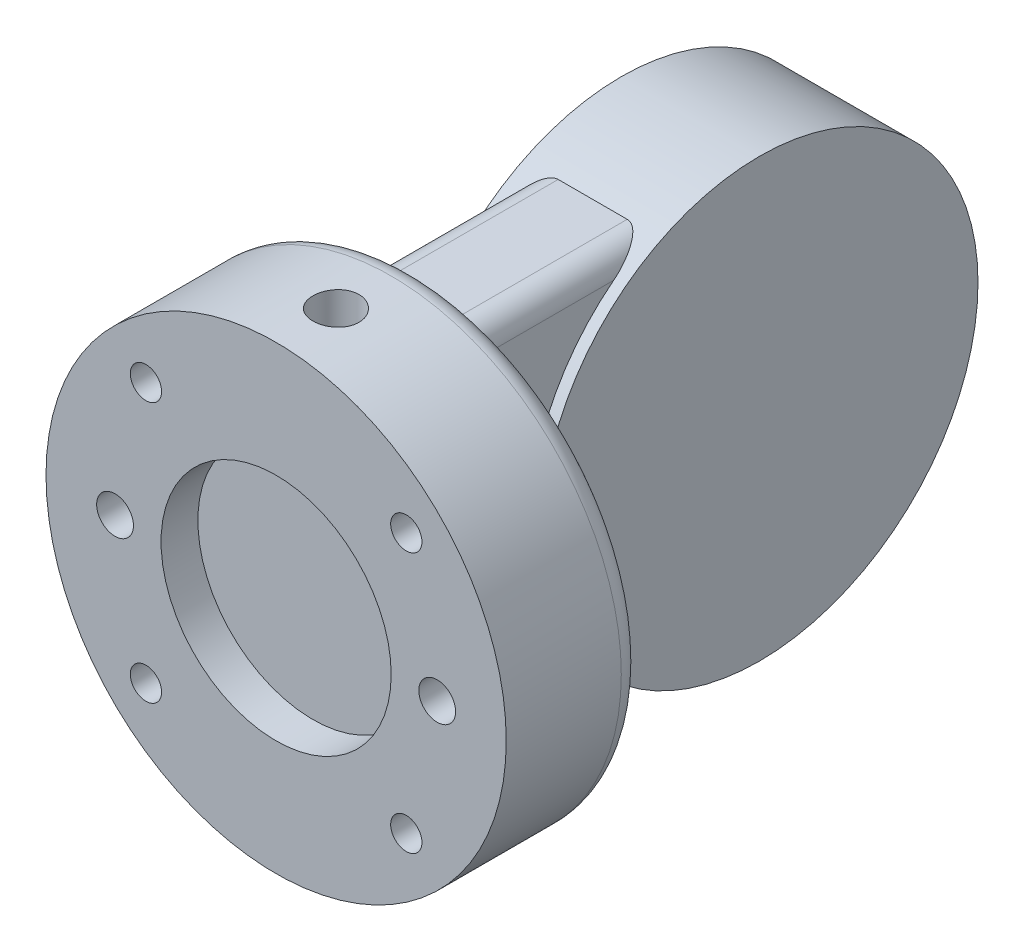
ISO-10303-21;
HEADER;
FILE_DESCRIPTION(('STEP AP214'),'2;1');
FILE_NAME('part.step','',(''),(''),'','','');
FILE_SCHEMA(('AUTOMOTIVE_DESIGN { 1 0 10303 214 1 1 1 1 }'));
ENDSEC;
DATA;
#1=APPLICATION_CONTEXT('core data for automotive mechanical design processes');
#2=APPLICATION_PROTOCOL_DEFINITION('international standard','automotive_design',2000,#1);
#3=PRODUCT_CONTEXT('',#1,'mechanical');
#4=PRODUCT('Part','Part','',(#3));
#5=PRODUCT_RELATED_PRODUCT_CATEGORY('part','',(#4));
#6=PRODUCT_DEFINITION_FORMATION('','',#4);
#7=PRODUCT_DEFINITION_CONTEXT('part definition',#1,'design');
#8=PRODUCT_DEFINITION('design','',#6,#7);
#9=PRODUCT_DEFINITION_SHAPE('','',#8);
#10=(LENGTH_UNIT() NAMED_UNIT(*) SI_UNIT(.MILLI.,.METRE.));
#11=(NAMED_UNIT(*) PLANE_ANGLE_UNIT() SI_UNIT($,.RADIAN.));
#12=(NAMED_UNIT(*) SI_UNIT($,.STERADIAN.) SOLID_ANGLE_UNIT());
#13=UNCERTAINTY_MEASURE_WITH_UNIT(LENGTH_MEASURE(1.E-05),#10,'distance_accuracy_value','');
#14=(GEOMETRIC_REPRESENTATION_CONTEXT(3) GLOBAL_UNCERTAINTY_ASSIGNED_CONTEXT((#13)) GLOBAL_UNIT_ASSIGNED_CONTEXT((#10,
#11,#12)) REPRESENTATION_CONTEXT('',''));
#15=CARTESIAN_POINT('',(0.,0.,0.));
#16=DIRECTION('',(0.,0.,1.));
#17=DIRECTION('',(1.,0.,0.));
#18=AXIS2_PLACEMENT_3D('',#15,#16,#17);
#19=CARTESIAN_POINT('',(12.5,-42.5,90.));
#20=DIRECTION('',(0.,1.,0.));
#21=DIRECTION('',(0.,0.,1.));
#22=AXIS2_PLACEMENT_3D('',#19,#20,#21);
#23=PLANE('',#22);
#24=DIRECTION('',(1.,0.,0.));
#25=VECTOR('',#24,1.);
#26=CARTESIAN_POINT('',(12.5,-42.5,60.));
#27=LINE('',#26,#25);
#28=CARTESIAN_POINT('',(-7.5,-42.5,60.));
#29=VERTEX_POINT('',#28);
#30=CARTESIAN_POINT('',(7.5,-42.5,60.));
#31=VERTEX_POINT('',#30);
#32=EDGE_CURVE('E193',#29,#31,#27,.T.);
#33=ORIENTED_EDGE('',*,*,#32,.F.);
#34=DIRECTION('',(0.,0.,-1.));
#35=VECTOR('',#34,1.);
#36=CARTESIAN_POINT('',(-7.5,-42.5,90.));
#37=LINE('',#36,#35);
#38=CARTESIAN_POINT('',(-7.5,-42.5,21.2132034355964));
#39=VERTEX_POINT('',#38);
#40=EDGE_CURVE('E403',#29,#39,#37,.T.);
#41=ORIENTED_EDGE('',*,*,#40,.T.);
#42=DIRECTION('',(-1.,0.,0.));
#43=VECTOR('',#42,1.);
#44=CARTESIAN_POINT('',(15.,-42.5,21.2132034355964));
#45=LINE('',#44,#43);
#46=CARTESIAN_POINT('',(7.5,-42.5,21.2132034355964));
#47=VERTEX_POINT('',#46);
#48=EDGE_CURVE('E210',#39,#47,#45,.F.);
#49=ORIENTED_EDGE('',*,*,#48,.T.);
#50=DIRECTION('',(0.,0.,-1.));
#51=VECTOR('',#50,1.);
#52=CARTESIAN_POINT('',(7.5,-42.5,60.));
#53=LINE('',#52,#51);
#54=EDGE_CURVE('E226',#47,#31,#53,.F.);
#55=ORIENTED_EDGE('',*,*,#54,.T.);
#56=EDGE_LOOP('',(#33,#41,#49,#55));
#57=FACE_BOUND('',#56,.T.);
#58=ADVANCED_FACE('F50',(#57),#23,.F.);
#59=CARTESIAN_POINT('',(12.5,42.5,90.));
#60=DIRECTION('',(0.,-1.,0.));
#61=DIRECTION('',(0.,0.,-1.));
#62=AXIS2_PLACEMENT_3D('',#59,#60,#61);
#63=PLANE('',#62);
#64=DIRECTION('',(-1.,0.,0.));
#65=VECTOR('',#64,1.);
#66=CARTESIAN_POINT('',(15.,42.5,21.2132034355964));
#67=LINE('',#66,#65);
#68=CARTESIAN_POINT('',(7.5,42.5,21.2132034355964));
#69=VERTEX_POINT('',#68);
#70=CARTESIAN_POINT('',(-7.5,42.5,21.2132034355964));
#71=VERTEX_POINT('',#70);
#72=EDGE_CURVE('E208',#69,#71,#67,.T.);
#73=ORIENTED_EDGE('',*,*,#72,.T.);
#74=DIRECTION('',(0.,0.,1.));
#75=VECTOR('',#74,1.);
#76=CARTESIAN_POINT('',(-7.5,42.5,90.));
#77=LINE('',#76,#75);
#78=CARTESIAN_POINT('',(-7.5,42.5,60.));
#79=VERTEX_POINT('',#78);
#80=EDGE_CURVE('E381',#71,#79,#77,.T.);
#81=ORIENTED_EDGE('',*,*,#80,.T.);
#82=DIRECTION('',(-1.,0.,0.));
#83=VECTOR('',#82,1.);
#84=CARTESIAN_POINT('',(12.5,42.5,60.));
#85=LINE('',#84,#83);
#86=CARTESIAN_POINT('',(7.5,42.5,60.));
#87=VERTEX_POINT('',#86);
#88=EDGE_CURVE('E190',#87,#79,#85,.T.);
#89=ORIENTED_EDGE('',*,*,#88,.F.);
#90=DIRECTION('',(0.,0.,1.));
#91=VECTOR('',#90,1.);
#92=CARTESIAN_POINT('',(7.5,42.5,21.2132034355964));
#93=LINE('',#92,#91);
#94=EDGE_CURVE('E76',#87,#69,#93,.F.);
#95=ORIENTED_EDGE('',*,*,#94,.T.);
#96=EDGE_LOOP('',(#73,#81,#89,#95));
#97=FACE_BOUND('',#96,.T.);
#98=ADVANCED_FACE('F306',(#97),#63,.F.);
#99=CARTESIAN_POINT('',(12.5,0.,0.));
#100=DIRECTION('',(1.,0.,0.));
#101=DIRECTION('',(0.,0.,-1.));
#102=AXIS2_PLACEMENT_3D('',#99,#100,#101);
#103=PLANE('',#102);
#104=DIRECTION('',(0.,-1.,0.));
#105=VECTOR('',#104,1.);
#106=CARTESIAN_POINT('',(12.5,0.,60.));
#107=LINE('',#106,#105);
#108=CARTESIAN_POINT('',(12.5,37.5,60.));
#109=VERTEX_POINT('',#108);
#110=CARTESIAN_POINT('',(12.5,-37.5,60.));
#111=VERTEX_POINT('',#110);
#112=EDGE_CURVE('E196',#109,#111,#107,.T.);
#113=ORIENTED_EDGE('',*,*,#112,.T.);
#114=DIRECTION('',(0.,0.,-1.));
#115=VECTOR('',#114,1.);
#116=CARTESIAN_POINT('',(12.5,-37.5,21.2132034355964));
#117=LINE('',#116,#115);
#118=CARTESIAN_POINT('',(12.5,-37.5,29.1547594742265));
#119=VERTEX_POINT('',#118);
#120=EDGE_CURVE('E377',#111,#119,#117,.T.);
#121=ORIENTED_EDGE('',*,*,#120,.T.);
#122=CARTESIAN_POINT('',(12.5,0.,0.));
#123=DIRECTION('',(1.,0.,0.));
#124=DIRECTION('',(0.,0.,-1.));
#125=AXIS2_PLACEMENT_3D('',#122,#123,#124);
#126=CIRCLE('',#125,47.5);
#127=CARTESIAN_POINT('',(12.5,37.5,29.1547594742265));
#128=VERTEX_POINT('',#127);
#129=EDGE_CURVE('E213',#128,#119,#126,.T.);
#130=ORIENTED_EDGE('',*,*,#129,.F.);
#131=DIRECTION('',(0.,0.,1.));
#132=VECTOR('',#131,1.);
#133=CARTESIAN_POINT('',(12.5,37.5,60.));
#134=LINE('',#133,#132);
#135=EDGE_CURVE('E370',#128,#109,#134,.T.);
#136=ORIENTED_EDGE('',*,*,#135,.T.);
#137=EDGE_LOOP('',(#113,#121,#130,#136));
#138=FACE_BOUND('',#137,.T.);
#139=ADVANCED_FACE('F312',(#138),#103,.T.);
#140=CARTESIAN_POINT('',(-12.5,0.,0.));
#141=DIRECTION('',(1.,0.,0.));
#142=DIRECTION('',(0.,0.,-1.));
#143=AXIS2_PLACEMENT_3D('',#140,#141,#142);
#144=PLANE('',#143);
#145=CARTESIAN_POINT('',(-12.5,0.,0.));
#146=DIRECTION('',(1.,0.,0.));
#147=DIRECTION('',(0.,0.,-1.));
#148=AXIS2_PLACEMENT_3D('',#145,#146,#147);
#149=CIRCLE('',#148,47.5);
#150=CARTESIAN_POINT('',(-12.5,37.5,29.1547594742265));
#151=VERTEX_POINT('',#150);
#152=CARTESIAN_POINT('',(-12.5,-37.5,29.1547594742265));
#153=VERTEX_POINT('',#152);
#154=EDGE_CURVE('E203',#151,#153,#149,.T.);
#155=ORIENTED_EDGE('',*,*,#154,.T.);
#156=DIRECTION('',(0.,0.,-1.));
#157=VECTOR('',#156,1.);
#158=CARTESIAN_POINT('',(-12.5,-37.5,0.));
#159=LINE('',#158,#157);
#160=CARTESIAN_POINT('',(-12.5,-37.5,60.));
#161=VERTEX_POINT('',#160);
#162=EDGE_CURVE('E383',#153,#161,#159,.F.);
#163=ORIENTED_EDGE('',*,*,#162,.T.);
#164=DIRECTION('',(0.,-1.,0.));
#165=VECTOR('',#164,1.);
#166=CARTESIAN_POINT('',(-12.5,0.,60.));
#167=LINE('',#166,#165);
#168=CARTESIAN_POINT('',(-12.5,37.5,60.));
#169=VERTEX_POINT('',#168);
#170=EDGE_CURVE('E216',#169,#161,#167,.T.);
#171=ORIENTED_EDGE('',*,*,#170,.F.);
#172=DIRECTION('',(0.,0.,1.));
#173=VECTOR('',#172,1.);
#174=CARTESIAN_POINT('',(-12.5,37.5,0.));
#175=LINE('',#174,#173);
#176=EDGE_CURVE('E401',#169,#151,#175,.F.);
#177=ORIENTED_EDGE('',*,*,#176,.T.);
#178=EDGE_LOOP('',(#155,#163,#171,#177));
#179=FACE_BOUND('',#178,.T.);
#180=ADVANCED_FACE('F327',(#179),#144,.F.);
#181=CARTESIAN_POINT('',(15.,0.,0.));
#182=DIRECTION('',(-1.,0.,0.));
#183=DIRECTION('',(0.,0.,1.));
#184=AXIS2_PLACEMENT_3D('',#181,#182,#183);
#185=CYLINDRICAL_SURFACE('',#184,47.5);
#186=ORIENTED_EDGE('',*,*,#72,.F.);
#187=CARTESIAN_POINT('',(7.5,42.5,21.2132034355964));
#188=CARTESIAN_POINT('',(7.5695817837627,42.5000138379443,21.2131727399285));
#189=CARTESIAN_POINT('',(7.63914403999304,42.4985479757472,21.2161124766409));
#190=CARTESIAN_POINT('',(7.77758587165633,42.4927650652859,21.2276939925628));
#191=CARTESIAN_POINT('',(7.84646620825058,42.4884516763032,21.236328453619));
#192=CARTESIAN_POINT('',(7.98223962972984,42.4771515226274,21.2589215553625));
#193=CARTESIAN_POINT('',(8.04914674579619,42.4701983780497,21.2728132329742));
#194=CARTESIAN_POINT('',(8.18143503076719,42.4537962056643,21.3055280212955));
#195=CARTESIAN_POINT('',(8.24681562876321,42.4443462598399,21.3243529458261));
#196=CARTESIAN_POINT('',(8.47500472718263,42.4068148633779,21.3989635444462));
#197=CARTESIAN_POINT('',(8.63287373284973,42.3724445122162,21.467039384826));
#198=CARTESIAN_POINT('',(8.93491233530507,42.2922581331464,21.6245853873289));
#199=CARTESIAN_POINT('',(9.07900195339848,42.2463802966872,21.7141709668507));
#200=CARTESIAN_POINT('',(9.33074778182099,42.1543749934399,21.8921681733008));
#201=CARTESIAN_POINT('',(9.44049614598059,42.1095329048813,21.9783434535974));
#202=CARTESIAN_POINT('',(9.6512517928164,42.0150272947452,22.1584707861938));
#203=CARTESIAN_POINT('',(9.7522527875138,41.9653603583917,22.2524283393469));
#204=CARTESIAN_POINT('',(9.94642993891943,41.86200508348,22.4462607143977));
#205=CARTESIAN_POINT('',(10.0395955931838,41.8083115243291,22.5461431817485));
#206=CARTESIAN_POINT('',(10.2187909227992,41.6975318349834,22.7503702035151));
#207=CARTESIAN_POINT('',(10.3048178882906,41.6404444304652,22.8547164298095));
#208=CARTESIAN_POINT('',(10.4679495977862,41.5250417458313,23.0637103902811));
#209=CARTESIAN_POINT('',(10.5452421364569,41.4668117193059,23.1682593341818));
#210=CARTESIAN_POINT('',(10.6942315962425,41.3478519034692,23.3799037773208));
#211=CARTESIAN_POINT('',(10.7659274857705,41.2871216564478,23.4869997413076));
#212=CARTESIAN_POINT('',(10.9733459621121,41.1014425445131,23.811413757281));
#213=CARTESIAN_POINT('',(11.1013197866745,40.9730627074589,24.0317536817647));
#214=CARTESIAN_POINT('',(11.3392794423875,40.7080661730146,24.4779689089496));
#215=CARTESIAN_POINT('',(11.4492163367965,40.5714283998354,24.7038574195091));
#216=CARTESIAN_POINT('',(11.6521511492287,40.2909810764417,25.1586609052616));
#217=CARTESIAN_POINT('',(11.7451525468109,40.1471730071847,25.3875752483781));
#218=CARTESIAN_POINT('',(11.9397466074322,39.8101424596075,25.9138278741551));
#219=CARTESIAN_POINT('',(12.0359888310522,39.6146994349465,26.2117283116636));
#220=CARTESIAN_POINT('',(12.2022025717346,39.2135925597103,26.808082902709));
#221=CARTESIAN_POINT('',(12.2721691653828,39.0079268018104,27.1065371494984));
#222=CARTESIAN_POINT('',(12.3566094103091,38.6936981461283,27.5514111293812));
#223=CARTESIAN_POINT('',(12.3812558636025,38.5886057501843,27.6984172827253));
#224=CARTESIAN_POINT('',(12.4238062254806,38.3762752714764,27.9918609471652));
#225=CARTESIAN_POINT('',(12.4417103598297,38.2690372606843,28.1382984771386));
#226=CARTESIAN_POINT('',(12.4705729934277,38.0525673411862,28.4303560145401));
#227=CARTESIAN_POINT('',(12.4815323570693,37.9433356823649,28.5759761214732));
#228=CARTESIAN_POINT('',(12.4962416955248,37.7230162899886,28.8661963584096));
#229=CARTESIAN_POINT('',(12.4999908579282,37.6119283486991,29.0107963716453));
#230=CARTESIAN_POINT('',(12.5,37.5,29.1547594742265));
#231=B_SPLINE_CURVE_WITH_KNOTS('',3,(#187,#188,#189,#190,#191,#192,#193,#194,#195,#196,#197,
#198,#199,#200,#201,#202,#203,#204,#205,#206,#207,#208,#209,#210,#211,#212,#213,#214,#215,#216,
#217,#218,#219,#220,#221,#222,#223,#224,#225,#226,#227,#228,#229,#230),.UNSPECIFIED.,.F.,.F.,(4,
2,2,2,2,2,2,2,2,2,2,2,2,2,2,2,2,2,2,2,2,4),(0.,0.208636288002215,0.417004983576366,
0.622804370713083,0.828679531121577,1.3514475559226,1.87708594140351,2.31615928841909,
2.75554568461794,3.19551194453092,3.63564445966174,4.0628553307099,4.49014476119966,
5.34515162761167,6.20244120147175,7.05955443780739,8.16561739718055,9.2718875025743,
9.81891635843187,10.365926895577,10.9128693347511,11.459873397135),.UNSPECIFIED.);
#232=EDGE_CURVE('E13',#69,#128,#231,.T.);
#233=ORIENTED_EDGE('',*,*,#232,.T.);
#234=ORIENTED_EDGE('',*,*,#129,.T.);
#235=CARTESIAN_POINT('',(12.5,-37.5,29.1547594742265));
#236=CARTESIAN_POINT('',(12.4999888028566,-37.6177770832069,29.0032742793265));
#237=CARTESIAN_POINT('',(12.4958386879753,-37.7346225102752,28.8510845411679));
#238=CARTESIAN_POINT('',(12.47957013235,-37.9662475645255,28.5455901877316));
#239=CARTESIAN_POINT('',(12.467452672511,-38.0810274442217,28.3922857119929));
#240=CARTESIAN_POINT('',(12.4355535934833,-38.3083849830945,28.0847686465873));
#241=CARTESIAN_POINT('',(12.415769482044,-38.4209619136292,27.9305557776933));
#242=CARTESIAN_POINT('',(12.3687642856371,-38.6437169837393,27.6215392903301));
#243=CARTESIAN_POINT('',(12.3415429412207,-38.7538950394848,27.4667356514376));
#244=CARTESIAN_POINT('',(12.2483979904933,-39.0827207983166,26.998834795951));
#245=CARTESIAN_POINT('',(12.1713014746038,-39.2975006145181,26.6851701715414));
#246=CARTESIAN_POINT('',(11.9881184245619,-39.7156062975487,26.05882414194));
#247=CARTESIAN_POINT('',(11.8820415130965,-39.9189359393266,25.7461424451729));
#248=CARTESIAN_POINT('',(11.6837581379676,-40.2418875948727,25.2367952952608));
#249=CARTESIAN_POINT('',(11.6003786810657,-40.3652196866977,25.0390148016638));
#250=CARTESIAN_POINT('',(11.4208052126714,-40.6064307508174,24.6459107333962));
#251=CARTESIAN_POINT('',(11.3246109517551,-40.7243096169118,24.4505872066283));
#252=CARTESIAN_POINT('',(11.1187303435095,-40.9537642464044,24.0642790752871));
#253=CARTESIAN_POINT('',(11.0090839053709,-41.0653572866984,23.8732835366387));
#254=CARTESIAN_POINT('',(10.7746079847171,-41.2818547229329,23.4969251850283));
#255=CARTESIAN_POINT('',(10.6497859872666,-41.3867623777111,23.3115596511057));
#256=CARTESIAN_POINT('',(10.4450824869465,-41.5415874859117,23.0338616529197));
#257=CARTESIAN_POINT('',(10.3714207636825,-41.5943153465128,22.9384918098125));
#258=CARTESIAN_POINT('',(10.2187018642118,-41.6972785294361,22.7507890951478));
#259=CARTESIAN_POINT('',(10.1396458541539,-41.7475143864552,22.6584555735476));
#260=CARTESIAN_POINT('',(9.97561113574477,-41.845165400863,22.4776041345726));
#261=CARTESIAN_POINT('',(9.89063247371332,-41.8925805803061,22.3890861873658));
#262=CARTESIAN_POINT('',(9.71419083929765,-41.9841081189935,22.2169794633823));
#263=CARTESIAN_POINT('',(9.62272960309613,-42.0282213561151,22.1333893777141));
#264=CARTESIAN_POINT('',(9.38810691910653,-42.1323246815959,21.9347878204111));
#265=CARTESIAN_POINT('',(9.24079354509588,-42.1900746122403,21.8233953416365));
#266=CARTESIAN_POINT('',(8.92906921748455,-42.2942266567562,21.6208544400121));
#267=CARTESIAN_POINT('',(8.76469088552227,-42.3406498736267,21.5296683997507));
#268=CARTESIAN_POINT('',(8.46752227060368,-42.4071537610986,21.3982981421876));
#269=CARTESIAN_POINT('',(8.33875962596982,-42.4309706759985,21.3509823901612));
#270=CARTESIAN_POINT('',(8.07438030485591,-42.4686776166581,21.2758837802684));
#271=CARTESIAN_POINT('',(7.93878475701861,-42.4825964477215,21.2480442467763));
#272=CARTESIAN_POINT('',(7.75167000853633,-42.4939159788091,21.225388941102));
#273=CARTESIAN_POINT('',(7.70148965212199,-42.4961925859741,21.2208300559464));
#274=CARTESIAN_POINT('',(7.6008807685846,-42.4992349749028,21.2147363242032));
#275=CARTESIAN_POINT('',(7.55045215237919,-42.5000001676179,21.2132026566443));
#276=CARTESIAN_POINT('',(7.5,-42.5,21.2132034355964));
#277=B_SPLINE_CURVE_WITH_KNOTS('',3,(#235,#236,#237,#238,#239,#240,#241,#242,#243,#244,#245,
#246,#247,#248,#249,#250,#251,#252,#253,#254,#255,#256,#257,#258,#259,#260,#261,#262,#263,#264,
#265,#266,#267,#268,#269,#270,#271,#272,#273,#274,#275,#276),.UNSPECIFIED.,.F.,.F.,(4,2,2,2,2,2,
2,2,2,2,2,2,2,2,2,2,2,2,2,2,4),(0.,0.575578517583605,1.15108618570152,1.72678109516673,
2.30249609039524,3.4648342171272,4.62678686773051,5.36908588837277,6.11139935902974,
6.85156153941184,7.59136011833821,7.98583095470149,8.38021678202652,8.77459952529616,
9.16887704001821,9.74781080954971,10.3256575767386,10.7418504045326,11.1568270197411,
11.3080497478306,11.4593314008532),.UNSPECIFIED.);
#278=EDGE_CURVE('E341',#119,#47,#277,.T.);
#279=ORIENTED_EDGE('',*,*,#278,.T.);
#280=ORIENTED_EDGE('',*,*,#48,.F.);
#281=CARTESIAN_POINT('',(-7.5,-42.5,21.2132034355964));
#282=CARTESIAN_POINT('',(-7.5695817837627,-42.5000138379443,21.2131727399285));
#283=CARTESIAN_POINT('',(-7.63914403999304,-42.4985479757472,21.2161124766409));
#284=CARTESIAN_POINT('',(-7.77758587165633,-42.4927650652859,21.2276939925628));
#285=CARTESIAN_POINT('',(-7.84646620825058,-42.4884516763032,21.236328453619));
#286=CARTESIAN_POINT('',(-7.98223962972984,-42.4771515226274,21.2589215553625));
#287=CARTESIAN_POINT('',(-8.04914674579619,-42.4701983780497,21.2728132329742));
#288=CARTESIAN_POINT('',(-8.18143503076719,-42.4537962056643,21.3055280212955));
#289=CARTESIAN_POINT('',(-8.24681562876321,-42.4443462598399,21.3243529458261));
#290=CARTESIAN_POINT('',(-8.47500472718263,-42.4068148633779,21.3989635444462));
#291=CARTESIAN_POINT('',(-8.63287373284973,-42.3724445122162,21.467039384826));
#292=CARTESIAN_POINT('',(-8.93491233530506,-42.2922581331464,21.6245853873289));
#293=CARTESIAN_POINT('',(-9.07900195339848,-42.2463802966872,21.7141709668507));
#294=CARTESIAN_POINT('',(-9.33074778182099,-42.1543749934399,21.8921681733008));
#295=CARTESIAN_POINT('',(-9.44049614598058,-42.1095329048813,21.9783434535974));
#296=CARTESIAN_POINT('',(-9.65125179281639,-42.0150272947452,22.1584707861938));
#297=CARTESIAN_POINT('',(-9.75225278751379,-41.9653603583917,22.2524283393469));
#298=CARTESIAN_POINT('',(-9.94642993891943,-41.86200508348,22.4462607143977));
#299=CARTESIAN_POINT('',(-10.0395955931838,-41.8083115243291,22.5461431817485));
#300=CARTESIAN_POINT('',(-10.2187909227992,-41.6975318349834,22.7503702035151));
#301=CARTESIAN_POINT('',(-10.3048178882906,-41.6404444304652,22.8547164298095));
#302=CARTESIAN_POINT('',(-10.4679495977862,-41.5250417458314,23.0637103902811));
#303=CARTESIAN_POINT('',(-10.5452421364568,-41.4668117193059,23.1682593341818));
#304=CARTESIAN_POINT('',(-10.6942315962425,-41.3478519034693,23.3799037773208));
#305=CARTESIAN_POINT('',(-10.7659274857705,-41.2871216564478,23.4869997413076));
#306=CARTESIAN_POINT('',(-10.9733459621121,-41.1014425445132,23.811413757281));
#307=CARTESIAN_POINT('',(-11.1013197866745,-40.9730627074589,24.0317536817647));
#308=CARTESIAN_POINT('',(-11.3392794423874,-40.7080661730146,24.4779689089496));
#309=CARTESIAN_POINT('',(-11.4492163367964,-40.5714283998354,24.7038574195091));
#310=CARTESIAN_POINT('',(-11.6521511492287,-40.2909810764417,25.1586609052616));
#311=CARTESIAN_POINT('',(-11.7451525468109,-40.1471730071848,25.3875752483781));
#312=CARTESIAN_POINT('',(-11.9397466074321,-39.8101424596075,25.913827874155));
#313=CARTESIAN_POINT('',(-12.0359888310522,-39.6146994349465,26.2117283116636));
#314=CARTESIAN_POINT('',(-12.2022025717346,-39.2135925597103,26.808082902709));
#315=CARTESIAN_POINT('',(-12.2721691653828,-39.0079268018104,27.1065371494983));
#316=CARTESIAN_POINT('',(-12.356609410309,-38.6936981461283,27.5514111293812));
#317=CARTESIAN_POINT('',(-12.3812558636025,-38.5886057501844,27.6984172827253));
#318=CARTESIAN_POINT('',(-12.4238062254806,-38.3762752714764,27.9918609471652));
#319=CARTESIAN_POINT('',(-12.4417103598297,-38.2690372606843,28.1382984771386));
#320=CARTESIAN_POINT('',(-12.4705729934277,-38.0525673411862,28.4303560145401));
#321=CARTESIAN_POINT('',(-12.4815323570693,-37.9433356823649,28.5759761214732));
#322=CARTESIAN_POINT('',(-12.4962416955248,-37.7230162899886,28.8661963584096));
#323=CARTESIAN_POINT('',(-12.4999908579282,-37.6119283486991,29.0107963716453));
#324=CARTESIAN_POINT('',(-12.5,-37.5,29.1547594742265));
#325=B_SPLINE_CURVE_WITH_KNOTS('',3,(#281,#282,#283,#284,#285,#286,#287,#288,#289,#290,#291,
#292,#293,#294,#295,#296,#297,#298,#299,#300,#301,#302,#303,#304,#305,#306,#307,#308,#309,#310,
#311,#312,#313,#314,#315,#316,#317,#318,#319,#320,#321,#322,#323,#324),.UNSPECIFIED.,.F.,.F.,(4,
2,2,2,2,2,2,2,2,2,2,2,2,2,2,2,2,2,2,2,2,4),(0.,0.208636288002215,0.417004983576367,
0.622804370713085,0.828679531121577,1.3514475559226,1.87708594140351,2.31615928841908,
2.75554568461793,3.19551194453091,3.63564445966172,4.06285533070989,4.49014476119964,
5.34515162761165,6.20244120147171,7.05955443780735,8.16561739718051,9.27188750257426,
9.81891635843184,10.365926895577,10.9128693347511,11.459873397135),.UNSPECIFIED.);
#326=EDGE_CURVE('E333',#39,#153,#325,.T.);
#327=ORIENTED_EDGE('',*,*,#326,.T.);
#328=ORIENTED_EDGE('',*,*,#154,.F.);
#329=CARTESIAN_POINT('',(-12.5,37.5,29.1547594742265));
#330=CARTESIAN_POINT('',(-12.4999888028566,37.6177770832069,29.0032742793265));
#331=CARTESIAN_POINT('',(-12.4958386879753,37.7346225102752,28.8510845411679));
#332=CARTESIAN_POINT('',(-12.47957013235,37.9662475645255,28.5455901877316));
#333=CARTESIAN_POINT('',(-12.467452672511,38.0810274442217,28.3922857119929));
#334=CARTESIAN_POINT('',(-12.4355535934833,38.3083849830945,28.0847686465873));
#335=CARTESIAN_POINT('',(-12.415769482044,38.4209619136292,27.9305557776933));
#336=CARTESIAN_POINT('',(-12.3687642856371,38.6437169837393,27.6215392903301));
#337=CARTESIAN_POINT('',(-12.3415429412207,38.7538950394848,27.4667356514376));
#338=CARTESIAN_POINT('',(-12.2483979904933,39.0827207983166,26.998834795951));
#339=CARTESIAN_POINT('',(-12.1713014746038,39.2975006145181,26.6851701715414));
#340=CARTESIAN_POINT('',(-11.9881184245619,39.7156062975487,26.05882414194));
#341=CARTESIAN_POINT('',(-11.8820415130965,39.9189359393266,25.7461424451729));
#342=CARTESIAN_POINT('',(-11.6837581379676,40.2418875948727,25.2367952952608));
#343=CARTESIAN_POINT('',(-11.6003786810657,40.3652196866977,25.0390148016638));
#344=CARTESIAN_POINT('',(-11.4208052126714,40.6064307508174,24.6459107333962));
#345=CARTESIAN_POINT('',(-11.3246109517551,40.7243096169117,24.4505872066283));
#346=CARTESIAN_POINT('',(-11.1187303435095,40.9537642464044,24.0642790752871));
#347=CARTESIAN_POINT('',(-11.0090839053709,41.0653572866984,23.8732835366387));
#348=CARTESIAN_POINT('',(-10.7746079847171,41.2818547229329,23.4969251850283));
#349=CARTESIAN_POINT('',(-10.6497859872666,41.386762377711,23.3115596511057));
#350=CARTESIAN_POINT('',(-10.4450824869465,41.5415874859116,23.0338616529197));
#351=CARTESIAN_POINT('',(-10.3714207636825,41.5943153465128,22.9384918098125));
#352=CARTESIAN_POINT('',(-10.2187018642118,41.6972785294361,22.7507890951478));
#353=CARTESIAN_POINT('',(-10.1396458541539,41.7475143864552,22.6584555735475));
#354=CARTESIAN_POINT('',(-9.97561113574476,41.845165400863,22.4776041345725));
#355=CARTESIAN_POINT('',(-9.89063247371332,41.8925805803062,22.3890861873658));
#356=CARTESIAN_POINT('',(-9.71419083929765,41.9841081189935,22.2169794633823));
#357=CARTESIAN_POINT('',(-9.62272960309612,42.0282213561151,22.1333893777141));
#358=CARTESIAN_POINT('',(-9.38810691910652,42.1323246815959,21.9347878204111));
#359=CARTESIAN_POINT('',(-9.24079354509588,42.1900746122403,21.8233953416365));
#360=CARTESIAN_POINT('',(-8.92906921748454,42.2942266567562,21.6208544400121));
#361=CARTESIAN_POINT('',(-8.76469088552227,42.3406498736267,21.5296683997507));
#362=CARTESIAN_POINT('',(-8.46752227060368,42.4071537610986,21.3982981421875));
#363=CARTESIAN_POINT('',(-8.33875962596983,42.4309706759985,21.3509823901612));
#364=CARTESIAN_POINT('',(-8.07438030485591,42.4686776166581,21.2758837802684));
#365=CARTESIAN_POINT('',(-7.93878475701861,42.4825964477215,21.2480442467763));
#366=CARTESIAN_POINT('',(-7.75167000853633,42.4939159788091,21.225388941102));
#367=CARTESIAN_POINT('',(-7.70148965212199,42.4961925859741,21.2208300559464));
#368=CARTESIAN_POINT('',(-7.6008807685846,42.4992349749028,21.2147363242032));
#369=CARTESIAN_POINT('',(-7.55045215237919,42.5000001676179,21.2132026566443));
#370=CARTESIAN_POINT('',(-7.5,42.5,21.2132034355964));
#371=B_SPLINE_CURVE_WITH_KNOTS('',3,(#329,#330,#331,#332,#333,#334,#335,#336,#337,#338,#339,
#340,#341,#342,#343,#344,#345,#346,#347,#348,#349,#350,#351,#352,#353,#354,#355,#356,#357,#358,
#359,#360,#361,#362,#363,#364,#365,#366,#367,#368,#369,#370),.UNSPECIFIED.,.F.,.F.,(4,2,2,2,2,2,
2,2,2,2,2,2,2,2,2,2,2,2,2,2,4),(0.,0.5755785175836,1.15108618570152,1.72678109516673,
2.30249609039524,3.4648342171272,4.62678686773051,5.36908588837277,6.11139935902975,
6.85156153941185,7.59136011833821,7.98583095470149,8.38021678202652,8.77459952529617,
9.16887704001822,9.74781080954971,10.3256575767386,10.7418504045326,11.1568270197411,
11.3080497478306,11.4593314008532),.UNSPECIFIED.);
#372=EDGE_CURVE('E69',#151,#71,#371,.T.);
#373=ORIENTED_EDGE('',*,*,#372,.T.);
#374=EDGE_LOOP('',(#186,#233,#234,#279,#280,#327,#328,#373));
#375=FACE_BOUND('',#374,.T.);
#376=CARTESIAN_POINT('',(15.,0.,0.));
#377=DIRECTION('',(1.,0.,0.));
#378=DIRECTION('',(0.,0.,-1.));
#379=AXIS2_PLACEMENT_3D('',#376,#377,#378);
#380=CIRCLE('',#379,47.5);
#381=CARTESIAN_POINT('',(15.,0.,-47.5));
#382=VERTEX_POINT('',#381);
#383=EDGE_CURVE('E200',#382,#382,#380,.T.);
#384=ORIENTED_EDGE('',*,*,#383,.F.);
#385=EDGE_LOOP('',(#384));
#386=FACE_BOUND('',#385,.T.);
#387=CARTESIAN_POINT('',(-15.,0.,0.));
#388=DIRECTION('',(1.,0.,0.));
#389=DIRECTION('',(0.,0.,-1.));
#390=AXIS2_PLACEMENT_3D('',#387,#388,#389);
#391=CIRCLE('',#390,47.5);
#392=CARTESIAN_POINT('',(-15.,0.,-47.5));
#393=VERTEX_POINT('',#392);
#394=EDGE_CURVE('E199',#393,#393,#391,.T.);
#395=ORIENTED_EDGE('',*,*,#394,.T.);
#396=EDGE_LOOP('',(#395));
#397=FACE_BOUND('',#396,.T.);
#398=ADVANCED_FACE('F320',(#375,#386,#397),#185,.T.);
#399=CARTESIAN_POINT('',(15.,0.,0.));
#400=DIRECTION('',(1.,0.,0.));
#401=DIRECTION('',(0.,0.,-1.));
#402=AXIS2_PLACEMENT_3D('',#399,#400,#401);
#403=PLANE('',#402);
#404=ORIENTED_EDGE('',*,*,#383,.T.);
#405=EDGE_LOOP('',(#404));
#406=FACE_BOUND('',#405,.T.);
#407=ADVANCED_FACE('F317',(#406),#403,.T.);
#408=CARTESIAN_POINT('',(-15.,0.,0.));
#409=DIRECTION('',(1.,0.,0.));
#410=DIRECTION('',(0.,0.,-1.));
#411=AXIS2_PLACEMENT_3D('',#408,#409,#410);
#412=PLANE('',#411);
#413=ORIENTED_EDGE('',*,*,#394,.F.);
#414=EDGE_LOOP('',(#413));
#415=FACE_BOUND('',#414,.T.);
#416=ADVANCED_FACE('F301',(#415),#412,.F.);
#417=CARTESIAN_POINT('',(0.,0.,60.));
#418=DIRECTION('',(0.,0.,1.));
#419=DIRECTION('',(1.,0.,0.));
#420=AXIS2_PLACEMENT_3D('',#417,#418,#419);
#421=CYLINDRICAL_SURFACE('',#420,50.);
#422=CARTESIAN_POINT('',(0.,0.,65.));
#423=DIRECTION('',(0.,0.,1.));
#424=DIRECTION('',(1.,0.,0.));
#425=AXIS2_PLACEMENT_3D('',#422,#423,#424);
#426=CIRCLE('',#425,50.);
#427=CARTESIAN_POINT('',(50.,0.,65.));
#428=VERTEX_POINT('',#427);
#429=EDGE_CURVE('E389',#428,#428,#426,.T.);
#430=ORIENTED_EDGE('',*,*,#429,.T.);
#431=EDGE_LOOP('',(#430));
#432=FACE_BOUND('',#431,.T.);
#433=CARTESIAN_POINT('',(0.,50.,82.));
#434=CARTESIAN_POINT('',(0.140100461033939,50.0000003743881,82.0000013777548));
#435=CARTESIAN_POINT('',(0.280179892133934,49.9994099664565,81.9941093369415));
#436=CARTESIAN_POINT('',(0.559384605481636,49.9970656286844,81.9705849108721));
#437=CARTESIAN_POINT('',(0.698509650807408,49.9953114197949,81.9529497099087));
#438=CARTESIAN_POINT('',(0.974876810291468,49.990686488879,81.9060450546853));
#439=CARTESIAN_POINT('',(1.11211733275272,49.9878148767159,81.8767663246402));
#440=CARTESIAN_POINT('',(1.38367953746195,49.9810352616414,81.806776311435));
#441=CARTESIAN_POINT('',(1.51800013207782,49.9771268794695,81.7660608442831));
#442=CARTESIAN_POINT('',(1.78258815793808,49.968388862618,81.673542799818));
#443=CARTESIAN_POINT('',(1.91285941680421,49.9635601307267,81.6217510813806));
#444=CARTESIAN_POINT('',(2.16861600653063,49.9531129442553,81.5074087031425));
#445=CARTESIAN_POINT('',(2.29409955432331,49.9474941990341,81.4448540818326));
#446=CARTESIAN_POINT('',(2.53927920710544,49.9356297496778,81.3094848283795));
#447=CARTESIAN_POINT('',(2.65897858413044,49.9293844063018,81.2366760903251));
#448=CARTESIAN_POINT('',(2.89187409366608,49.9164369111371,81.0812584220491));
#449=CARTESIAN_POINT('',(3.00506780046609,49.90973459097,80.9986458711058));
#450=CARTESIAN_POINT('',(3.22442516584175,49.8960438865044,80.8239762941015));
#451=CARTESIAN_POINT('',(3.33056800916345,49.8890547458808,80.7318931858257));
#452=CARTESIAN_POINT('',(3.53476522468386,49.8750029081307,80.5390902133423));
#453=CARTESIAN_POINT('',(3.6328165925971,49.8679401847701,80.4383671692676));
#454=CARTESIAN_POINT('',(3.82006793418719,49.853945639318,80.2290545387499));
#455=CARTESIAN_POINT('',(3.90927074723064,49.8470137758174,80.1204674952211));
#456=CARTESIAN_POINT('',(4.07826305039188,49.8334722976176,79.8961182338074));
#457=CARTESIAN_POINT('',(4.15804905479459,49.8268628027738,79.7803533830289));
#458=CARTESIAN_POINT('',(4.30773494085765,49.8141453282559,79.5422870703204));
#459=CARTESIAN_POINT('',(4.37761719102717,49.8080382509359,79.4199744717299));
#460=CARTESIAN_POINT('',(4.50685113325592,49.796510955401,79.1698210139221));
#461=CARTESIAN_POINT('',(4.5661989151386,49.7910909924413,79.0419781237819));
#462=CARTESIAN_POINT('',(4.67388203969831,49.7810984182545,78.7817509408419));
#463=CARTESIAN_POINT('',(4.72222165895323,49.7765254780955,78.6493684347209));
#464=CARTESIAN_POINT('',(4.80757979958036,49.7683532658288,78.3809589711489));
#465=CARTESIAN_POINT('',(4.84459415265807,49.7647543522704,78.2449306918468));
#466=CARTESIAN_POINT('',(4.93794230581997,49.7556112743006,77.8338494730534));
#467=CARTESIAN_POINT('',(4.97706409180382,49.7516744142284,77.5546295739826));
#468=CARTESIAN_POINT('',(5.00789059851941,49.7485802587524,76.9937132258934));
#469=CARTESIAN_POINT('',(4.9995965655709,49.7494228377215,76.7120168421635));
#470=CARTESIAN_POINT('',(4.93601762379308,49.7557708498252,76.1550347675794));
#471=CARTESIAN_POINT('',(4.88090320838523,49.7612593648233,75.8797295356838));
#472=CARTESIAN_POINT('',(4.72549673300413,49.7762565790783,75.3423071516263));
#473=CARTESIAN_POINT('',(4.62520406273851,49.7857653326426,75.0801901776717));
#474=CARTESIAN_POINT('',(4.3821041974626,49.8077505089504,74.576032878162));
#475=CARTESIAN_POINT('',(4.23922134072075,49.8202322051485,74.3340292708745));
#476=CARTESIAN_POINT('',(3.9150502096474,49.846752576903,73.8773737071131));
#477=CARTESIAN_POINT('',(3.73376081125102,49.8607912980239,73.6627225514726));
#478=CARTESIAN_POINT('',(3.33697054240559,49.8889192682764,73.2658730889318));
#479=CARTESIAN_POINT('',(3.12132238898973,49.9030084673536,73.0838220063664));
#480=CARTESIAN_POINT('',(2.66244741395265,49.9295914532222,72.7584818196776));
#481=CARTESIAN_POINT('',(2.41922056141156,49.9420852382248,72.6151927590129));
#482=CARTESIAN_POINT('',(1.91199052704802,49.9640737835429,72.3714499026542));
#483=CARTESIAN_POINT('',(1.64798373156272,49.9735680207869,72.2710035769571));
#484=CARTESIAN_POINT('',(1.10673608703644,49.988482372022,72.1159054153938));
#485=CARTESIAN_POINT('',(0.829495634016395,49.9939026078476,72.0612522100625));
#486=CARTESIAN_POINT('',(0.270925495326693,50.0000425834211,71.9994784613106));
#487=CARTESIAN_POINT('',(-0.0103815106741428,50.000782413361,71.992154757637));
#488=CARTESIAN_POINT('',(-0.570218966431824,49.9975320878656,72.0247143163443));
#489=CARTESIAN_POINT('',(-0.848749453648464,49.993541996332,72.0645969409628));
#490=CARTESIAN_POINT('',(-1.39454103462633,49.9812930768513,72.1902684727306));
#491=CARTESIAN_POINT('',(-1.66182424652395,49.9730430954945,72.2759622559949));
#492=CARTESIAN_POINT('',(-2.17822160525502,49.953199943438,72.4907258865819));
#493=CARTESIAN_POINT('',(-2.42733534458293,49.9416066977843,72.6197967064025));
#494=CARTESIAN_POINT('',(-2.90124090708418,49.9163237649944,72.9181541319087));
#495=CARTESIAN_POINT('',(-3.12594832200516,49.9026271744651,73.0875742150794));
#496=CARTESIAN_POINT('',(-3.54380809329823,49.8746966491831,73.4616305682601));
#497=CARTESIAN_POINT('',(-3.73695965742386,49.8604627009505,73.666267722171));
#498=CARTESIAN_POINT('',(-4.08693063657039,49.8330011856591,74.1058320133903));
#499=CARTESIAN_POINT('',(-4.2436167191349,49.8197774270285,74.340865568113));
#500=CARTESIAN_POINT('',(-4.5152909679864,49.7958917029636,74.8340400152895));
#501=CARTESIAN_POINT('',(-4.63027970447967,49.7852297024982,75.0921805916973));
#502=CARTESIAN_POINT('',(-4.81507725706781,49.7676970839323,75.6237317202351));
#503=CARTESIAN_POINT('',(-4.88496539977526,49.7608198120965,75.8971145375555));
#504=CARTESIAN_POINT('',(-4.97781551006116,49.7516193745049,76.4519606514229));
#505=CARTESIAN_POINT('',(-5.00077882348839,49.7492960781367,76.7334237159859));
#506=CARTESIAN_POINT('',(-4.99958027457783,49.7494127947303,77.1546072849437));
#507=CARTESIAN_POINT('',(-4.99328044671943,49.7500479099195,77.2945992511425));
#508=CARTESIAN_POINT('',(-4.96896519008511,49.7524830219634,77.5735377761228));
#509=CARTESIAN_POINT('',(-4.9509541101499,49.754282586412,77.7124847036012));
#510=CARTESIAN_POINT('',(-4.90333392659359,49.7589979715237,77.9883995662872));
#511=CARTESIAN_POINT('',(-4.87372057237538,49.7619142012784,78.1253667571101));
#512=CARTESIAN_POINT('',(-4.80312740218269,49.7687776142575,78.3962623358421));
#513=CARTESIAN_POINT('',(-4.7621517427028,49.7727244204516,78.5301918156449));
#514=CARTESIAN_POINT('',(-4.66911475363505,49.7815382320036,78.7941445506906));
#515=CARTESIAN_POINT('',(-4.61705096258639,49.7864054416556,78.9241669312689));
#516=CARTESIAN_POINT('',(-4.50223825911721,49.7969192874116,79.1793150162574));
#517=CARTESIAN_POINT('',(-4.43949325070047,49.8025656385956,79.3044424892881));
#518=CARTESIAN_POINT('',(-4.30372744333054,49.8144815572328,79.5490193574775));
#519=CARTESIAN_POINT('',(-4.23070301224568,49.82075134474,79.6684667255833));
#520=CARTESIAN_POINT('',(-4.07493978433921,49.8337332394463,79.9007610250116));
#521=CARTESIAN_POINT('',(-3.99220451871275,49.8404451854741,80.013610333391));
#522=CARTESIAN_POINT('',(-3.81717528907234,49.8541564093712,80.2324754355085));
#523=CARTESIAN_POINT('',(-3.72483897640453,49.8611568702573,80.3384572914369));
#524=CARTESIAN_POINT('',(-3.53161206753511,49.8752152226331,80.5422344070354));
#525=CARTESIAN_POINT('',(-3.43072460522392,49.8822730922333,80.640032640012));
#526=CARTESIAN_POINT('',(-3.22101009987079,49.8962537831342,80.8268559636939));
#527=CARTESIAN_POINT('',(-3.11217826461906,49.9031765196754,80.915875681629));
#528=CARTESIAN_POINT('',(-2.88743471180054,49.9166844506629,81.0844145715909));
#529=CARTESIAN_POINT('',(-2.77152562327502,49.9232697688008,81.1639372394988));
#530=CARTESIAN_POINT('',(-2.53305926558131,49.9359380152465,81.3131718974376));
#531=CARTESIAN_POINT('',(-2.41048371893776,49.9420194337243,81.3828548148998));
#532=CARTESIAN_POINT('',(-2.15990777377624,49.9534835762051,81.511610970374));
#533=CARTESIAN_POINT('',(-2.03190938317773,49.9588665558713,81.5706880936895));
#534=CARTESIAN_POINT('',(-1.77145809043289,49.9687792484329,81.6777926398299));
#535=CARTESIAN_POINT('',(-1.63900893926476,49.9733096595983,81.7258291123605));
#536=CARTESIAN_POINT('',(-1.37054695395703,49.9813929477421,81.8105524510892));
#537=CARTESIAN_POINT('',(-1.23453500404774,49.9849460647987,81.8472421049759));
#538=CARTESIAN_POINT('',(-0.917364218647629,49.9919068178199,81.9185766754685));
#539=CARTESIAN_POINT('',(-0.735250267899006,49.9949297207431,81.9490810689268));
#540=CARTESIAN_POINT('',(-0.368745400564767,49.9989760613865,81.9897917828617));
#541=CARTESIAN_POINT('',(-0.184354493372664,49.9999995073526,81.9999981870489));
#542=CARTESIAN_POINT('',(0.,50.,82.));
#543=B_SPLINE_CURVE_WITH_KNOTS('',3,(#433,#434,#435,#436,#437,#438,#439,#440,#441,#442,#443,
#444,#445,#446,#447,#448,#449,#450,#451,#452,#453,#454,#455,#456,#457,#458,#459,#460,#461,#462,
#463,#464,#465,#466,#467,#468,#469,#470,#471,#472,#473,#474,#475,#476,#477,#478,#479,#480,#481,
#482,#483,#484,#485,#486,#487,#488,#489,#490,#491,#492,#493,#494,#495,#496,#497,#498,#499,#500,
#501,#502,#503,#504,#505,#506,#507,#508,#509,#510,#511,#512,#513,#514,#515,#516,#517,#518,#519,
#520,#521,#522,#523,#524,#525,#526,#527,#528,#529,#530,#531,#532,#533,#534,#535,#536,#537,#538,
#539,#540,#541,#542),.UNSPECIFIED.,.T.,.F.,(4,2,2,2,2,2,2,2,2,2,2,2,2,2,2,2,2,2,2,2,2,2,2,2,2,2,
2,2,2,2,2,2,2,2,2,2,2,2,2,2,2,2,2,2,2,2,2,2,2,2,2,2,2,2,4),(0.,0.42014016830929,
0.840381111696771,1.26095751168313,1.68168797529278,2.10200784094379,2.5224827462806,
2.94271694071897,3.36310682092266,3.78468715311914,4.20642331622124,4.62802370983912,
5.04977967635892,5.47227730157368,5.89493142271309,6.31742106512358,6.74006601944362,
7.58160289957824,8.42311766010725,9.26158116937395,10.1000560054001,10.9400293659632,
11.7800273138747,12.6237280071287,13.467429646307,14.3112783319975,15.1551017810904,
15.9953007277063,16.8354883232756,17.6739380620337,18.5124065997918,19.3536883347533,
20.1949911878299,21.0393234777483,21.8836442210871,22.7264758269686,23.5692832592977,
23.9892798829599,24.4091206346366,24.8291153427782,25.2489566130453,25.6688911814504,
26.0886725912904,26.5086027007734,26.9283805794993,27.3500956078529,27.7716567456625,
28.1934743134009,28.6151361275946,29.0380188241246,29.4607462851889,29.883126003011,
30.305401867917,30.8582554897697,31.4111068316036),.UNSPECIFIED.);
#544=CARTESIAN_POINT('',(0.,50.,82.));
#545=VERTEX_POINT('',#544);
#546=EDGE_CURVE('E219',#545,#545,#543,.T.);
#547=ORIENTED_EDGE('',*,*,#546,.F.);
#548=EDGE_LOOP('',(#547));
#549=FACE_BOUND('',#548,.T.);
#550=CARTESIAN_POINT('',(0.,0.,90.));
#551=DIRECTION('',(0.,0.,1.));
#552=DIRECTION('',(1.,0.,0.));
#553=AXIS2_PLACEMENT_3D('',#550,#551,#552);
#554=CIRCLE('',#553,50.);
#555=CARTESIAN_POINT('',(50.,0.,90.));
#556=VERTEX_POINT('',#555);
#557=EDGE_CURVE('E185',#556,#556,#554,.T.);
#558=ORIENTED_EDGE('',*,*,#557,.F.);
#559=EDGE_LOOP('',(#558));
#560=FACE_BOUND('',#559,.T.);
#561=ADVANCED_FACE('F228',(#432,#549,#560),#421,.T.);
#562=CARTESIAN_POINT('',(0.,0.,60.));
#563=DIRECTION('',(0.,0.,1.));
#564=DIRECTION('',(1.,0.,0.));
#565=AXIS2_PLACEMENT_3D('',#562,#563,#564);
#566=PLANE('',#565);
#567=CARTESIAN_POINT('',(0.,0.,60.));
#568=DIRECTION('',(0.,0.,1.));
#569=DIRECTION('',(1.,0.,0.));
#570=AXIS2_PLACEMENT_3D('',#567,#568,#569);
#571=CIRCLE('',#570,45.);
#572=CARTESIAN_POINT('',(45.,0.,60.));
#573=VERTEX_POINT('',#572);
#574=EDGE_CURVE('E391',#573,#573,#571,.F.);
#575=ORIENTED_EDGE('',*,*,#574,.T.);
#576=EDGE_LOOP('',(#575));
#577=FACE_BOUND('',#576,.T.);
#578=ORIENTED_EDGE('',*,*,#112,.F.);
#579=CARTESIAN_POINT('',(7.5,37.5,60.));
#580=DIRECTION('',(0.,0.,1.));
#581=DIRECTION('',(1.,0.,0.));
#582=AXIS2_PLACEMENT_3D('',#579,#580,#581);
#583=CIRCLE('',#582,5.);
#584=EDGE_CURVE('E62',#109,#87,#583,.T.);
#585=ORIENTED_EDGE('',*,*,#584,.T.);
#586=ORIENTED_EDGE('',*,*,#88,.T.);
#587=CARTESIAN_POINT('',(-7.5,37.5,60.));
#588=DIRECTION('',(0.,0.,1.));
#589=DIRECTION('',(1.,0.,0.));
#590=AXIS2_PLACEMENT_3D('',#587,#588,#589);
#591=CIRCLE('',#590,5.);
#592=EDGE_CURVE('E352',#79,#169,#591,.T.);
#593=ORIENTED_EDGE('',*,*,#592,.T.);
#594=ORIENTED_EDGE('',*,*,#170,.T.);
#595=CARTESIAN_POINT('',(-7.5,-37.5,60.));
#596=DIRECTION('',(0.,0.,1.));
#597=DIRECTION('',(1.,0.,0.));
#598=AXIS2_PLACEMENT_3D('',#595,#596,#597);
#599=CIRCLE('',#598,5.);
#600=EDGE_CURVE('E393',#161,#29,#599,.T.);
#601=ORIENTED_EDGE('',*,*,#600,.T.);
#602=ORIENTED_EDGE('',*,*,#32,.T.);
#603=CARTESIAN_POINT('',(7.5,-37.5,60.));
#604=DIRECTION('',(0.,0.,1.));
#605=DIRECTION('',(1.,0.,0.));
#606=AXIS2_PLACEMENT_3D('',#603,#604,#605);
#607=CIRCLE('',#606,5.);
#608=EDGE_CURVE('E396',#31,#111,#607,.T.);
#609=ORIENTED_EDGE('',*,*,#608,.T.);
#610=EDGE_LOOP('',(#578,#585,#586,#593,#594,#601,#602,#609));
#611=FACE_BOUND('',#610,.T.);
#612=ADVANCED_FACE('F292',(#577,#611),#566,.F.);
#613=CARTESIAN_POINT('',(12.5,42.5,90.));
#614=DIRECTION('',(0.,0.,-1.));
#615=DIRECTION('',(-1.,0.,0.));
#616=AXIS2_PLACEMENT_3D('',#613,#614,#615);
#617=PLANE('',#616);
#618=CARTESIAN_POINT('',(-28.284271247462,-28.2842712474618,90.));
#619=DIRECTION('',(0.,0.,1.));
#620=DIRECTION('',(1.,0.,0.));
#621=AXIS2_PLACEMENT_3D('',#618,#619,#620);
#622=CIRCLE('',#621,3.4);
#623=CARTESIAN_POINT('',(-24.884271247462,-28.2842712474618,90.));
#624=VERTEX_POINT('',#623);
#625=EDGE_CURVE('E143',#624,#624,#622,.T.);
#626=ORIENTED_EDGE('',*,*,#625,.F.);
#627=EDGE_LOOP('',(#626));
#628=FACE_BOUND('',#627,.T.);
#629=CARTESIAN_POINT('',(28.2842712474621,-28.2842712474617,90.));
#630=DIRECTION('',(0.,0.,1.));
#631=DIRECTION('',(1.,0.,0.));
#632=AXIS2_PLACEMENT_3D('',#629,#630,#631);
#633=CIRCLE('',#632,3.4);
#634=CARTESIAN_POINT('',(31.6842712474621,-28.2842712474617,90.));
#635=VERTEX_POINT('',#634);
#636=EDGE_CURVE('E151',#635,#635,#633,.T.);
#637=ORIENTED_EDGE('',*,*,#636,.F.);
#638=EDGE_LOOP('',(#637));
#639=FACE_BOUND('',#638,.T.);
#640=CARTESIAN_POINT('',(28.2842712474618,28.284271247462,90.));
#641=DIRECTION('',(0.,0.,1.));
#642=DIRECTION('',(1.,0.,0.));
#643=AXIS2_PLACEMENT_3D('',#640,#641,#642);
#644=CIRCLE('',#643,3.4);
#645=CARTESIAN_POINT('',(31.6842712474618,28.284271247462,90.));
#646=VERTEX_POINT('',#645);
#647=EDGE_CURVE('E157',#646,#646,#644,.T.);
#648=ORIENTED_EDGE('',*,*,#647,.F.);
#649=EDGE_LOOP('',(#648));
#650=FACE_BOUND('',#649,.T.);
#651=CARTESIAN_POINT('',(-28.2842712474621,28.2842712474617,90.));
#652=DIRECTION('',(0.,0.,1.));
#653=DIRECTION('',(1.,0.,0.));
#654=AXIS2_PLACEMENT_3D('',#651,#652,#653);
#655=CIRCLE('',#654,3.4);
#656=CARTESIAN_POINT('',(-24.8842712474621,28.2842712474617,90.));
#657=VERTEX_POINT('',#656);
#658=EDGE_CURVE('E163',#657,#657,#655,.T.);
#659=ORIENTED_EDGE('',*,*,#658,.F.);
#660=EDGE_LOOP('',(#659));
#661=FACE_BOUND('',#660,.T.);
#662=CARTESIAN_POINT('',(35.,0.,90.));
#663=DIRECTION('',(0.,0.,1.));
#664=DIRECTION('',(1.,0.,0.));
#665=AXIS2_PLACEMENT_3D('',#662,#663,#664);
#666=CIRCLE('',#665,4.00000000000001);
#667=CARTESIAN_POINT('',(39.,0.,90.));
#668=VERTEX_POINT('',#667);
#669=EDGE_CURVE('E174',#668,#668,#666,.T.);
#670=ORIENTED_EDGE('',*,*,#669,.F.);
#671=EDGE_LOOP('',(#670));
#672=FACE_BOUND('',#671,.T.);
#673=CARTESIAN_POINT('',(-35.,0.,90.));
#674=DIRECTION('',(0.,0.,1.));
#675=DIRECTION('',(1.,0.,0.));
#676=AXIS2_PLACEMENT_3D('',#673,#674,#675);
#677=CIRCLE('',#676,4.);
#678=CARTESIAN_POINT('',(-31.,0.,90.));
#679=VERTEX_POINT('',#678);
#680=EDGE_CURVE('E177',#679,#679,#677,.T.);
#681=ORIENTED_EDGE('',*,*,#680,.F.);
#682=EDGE_LOOP('',(#681));
#683=FACE_BOUND('',#682,.T.);
#684=CARTESIAN_POINT('',(0.,0.,90.));
#685=DIRECTION('',(0.,0.,1.));
#686=DIRECTION('',(1.,0.,0.));
#687=AXIS2_PLACEMENT_3D('',#684,#685,#686);
#688=CIRCLE('',#687,25.);
#689=CARTESIAN_POINT('',(25.,0.,90.));
#690=VERTEX_POINT('',#689);
#691=EDGE_CURVE('E173',#690,#690,#688,.T.);
#692=ORIENTED_EDGE('',*,*,#691,.F.);
#693=EDGE_LOOP('',(#692));
#694=FACE_BOUND('',#693,.T.);
#695=ORIENTED_EDGE('',*,*,#557,.T.);
#696=EDGE_LOOP('',(#695));
#697=FACE_BOUND('',#696,.T.);
#698=ADVANCED_FACE('F290',(#628,#639,#650,#661,#672,#683,#694,#697),#617,.F.);
#699=CARTESIAN_POINT('',(0.,0.,82.));
#700=DIRECTION('',(0.,0.,1.));
#701=DIRECTION('',(1.,0.,0.));
#702=AXIS2_PLACEMENT_3D('',#699,#700,#701);
#703=CYLINDRICAL_SURFACE('',#702,25.);
#704=CARTESIAN_POINT('',(0.,0.,82.));
#705=DIRECTION('',(0.,0.,1.));
#706=DIRECTION('',(1.,0.,0.));
#707=AXIS2_PLACEMENT_3D('',#704,#705,#706);
#708=CIRCLE('',#707,25.);
#709=CARTESIAN_POINT('',(25.,0.,82.));
#710=VERTEX_POINT('',#709);
#711=EDGE_CURVE('E182',#710,#710,#708,.T.);
#712=ORIENTED_EDGE('',*,*,#711,.F.);
#713=EDGE_LOOP('',(#712));
#714=FACE_BOUND('',#713,.T.);
#715=ORIENTED_EDGE('',*,*,#691,.T.);
#716=EDGE_LOOP('',(#715));
#717=FACE_BOUND('',#716,.T.);
#718=ADVANCED_FACE('F287',(#714,#717),#703,.F.);
#719=CARTESIAN_POINT('',(0.,0.,82.));
#720=DIRECTION('',(0.,0.,1.));
#721=DIRECTION('',(1.,0.,0.));
#722=AXIS2_PLACEMENT_3D('',#719,#720,#721);
#723=PLANE('',#722);
#724=ORIENTED_EDGE('',*,*,#711,.T.);
#725=EDGE_LOOP('',(#724));
#726=FACE_BOUND('',#725,.T.);
#727=ADVANCED_FACE('F280',(#726),#723,.T.);
#728=CARTESIAN_POINT('',(-35.,0.,75.));
#729=DIRECTION('',(0.,0.,1.));
#730=DIRECTION('',(1.,0.,0.));
#731=AXIS2_PLACEMENT_3D('',#728,#729,#730);
#732=CYLINDRICAL_SURFACE('',#731,4.);
#733=CARTESIAN_POINT('',(-35.,0.,75.));
#734=DIRECTION('',(0.,0.,1.));
#735=DIRECTION('',(1.,0.,0.));
#736=AXIS2_PLACEMENT_3D('',#733,#734,#735);
#737=CIRCLE('',#736,4.);
#738=CARTESIAN_POINT('',(-31.,0.,75.));
#739=VERTEX_POINT('',#738);
#740=EDGE_CURVE('E169',#739,#739,#737,.T.);
#741=ORIENTED_EDGE('',*,*,#740,.F.);
#742=EDGE_LOOP('',(#741));
#743=FACE_BOUND('',#742,.T.);
#744=ORIENTED_EDGE('',*,*,#680,.T.);
#745=EDGE_LOOP('',(#744));
#746=FACE_BOUND('',#745,.T.);
#747=ADVANCED_FACE('F277',(#743,#746),#732,.F.);
#748=CARTESIAN_POINT('',(-35.,0.,75.));
#749=DIRECTION('',(0.,0.,1.));
#750=DIRECTION('',(1.,0.,0.));
#751=AXIS2_PLACEMENT_3D('',#748,#749,#750);
#752=PLANE('',#751);
#753=ORIENTED_EDGE('',*,*,#740,.T.);
#754=EDGE_LOOP('',(#753));
#755=FACE_BOUND('',#754,.T.);
#756=ADVANCED_FACE('F275',(#755),#752,.T.);
#757=CARTESIAN_POINT('',(35.,0.,75.));
#758=DIRECTION('',(0.,0.,1.));
#759=DIRECTION('',(1.,0.,0.));
#760=AXIS2_PLACEMENT_3D('',#757,#758,#759);
#761=CYLINDRICAL_SURFACE('',#760,4.00000000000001);
#762=CARTESIAN_POINT('',(35.,0.,75.));
#763=DIRECTION('',(0.,0.,1.));
#764=DIRECTION('',(1.,0.,0.));
#765=AXIS2_PLACEMENT_3D('',#762,#763,#764);
#766=CIRCLE('',#765,4.00000000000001);
#767=CARTESIAN_POINT('',(39.,0.,75.));
#768=VERTEX_POINT('',#767);
#769=EDGE_CURVE('E170',#768,#768,#766,.T.);
#770=ORIENTED_EDGE('',*,*,#769,.F.);
#771=EDGE_LOOP('',(#770));
#772=FACE_BOUND('',#771,.T.);
#773=ORIENTED_EDGE('',*,*,#669,.T.);
#774=EDGE_LOOP('',(#773));
#775=FACE_BOUND('',#774,.T.);
#776=ADVANCED_FACE('F271',(#772,#775),#761,.F.);
#777=CARTESIAN_POINT('',(0.,0.,75.));
#778=DIRECTION('',(0.,0.,1.));
#779=DIRECTION('',(1.,0.,0.));
#780=AXIS2_PLACEMENT_3D('',#777,#778,#779);
#781=PLANE('',#780);
#782=ORIENTED_EDGE('',*,*,#769,.T.);
#783=EDGE_LOOP('',(#782));
#784=FACE_BOUND('',#783,.T.);
#785=ADVANCED_FACE('F267',(#784),#781,.T.);
#786=CARTESIAN_POINT('',(-28.2842712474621,28.2842712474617,66.));
#787=DIRECTION('',(0.,0.,1.));
#788=DIRECTION('',(1.,0.,0.));
#789=AXIS2_PLACEMENT_3D('',#786,#787,#788);
#790=CONICAL_SURFACE('',#789,3.39999999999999,1.02974425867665);
#791=CARTESIAN_POINT('',(-28.2842712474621,28.2842712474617,63.9570738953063));
#792=VERTEX_POINT('',#791);
#793=VERTEX_LOOP('',#792);
#794=FACE_BOUND('',#793,.T.);
#795=CARTESIAN_POINT('',(-28.2842712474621,28.2842712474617,66.));
#796=DIRECTION('',(0.,0.,1.));
#797=DIRECTION('',(1.,0.,0.));
#798=AXIS2_PLACEMENT_3D('',#795,#796,#797);
#799=CIRCLE('',#798,3.39999999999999);
#800=CARTESIAN_POINT('',(-24.8842712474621,28.2842712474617,66.));
#801=VERTEX_POINT('',#800);
#802=EDGE_CURVE('E166',#801,#801,#799,.T.);
#803=ORIENTED_EDGE('',*,*,#802,.T.);
#804=EDGE_LOOP('',(#803));
#805=FACE_BOUND('',#804,.T.);
#806=ADVANCED_FACE('F263',(#794,#805),#790,.F.);
#807=CARTESIAN_POINT('',(-28.2842712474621,28.2842712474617,90.));
#808=DIRECTION('',(0.,0.,1.));
#809=DIRECTION('',(1.,0.,0.));
#810=AXIS2_PLACEMENT_3D('',#807,#808,#809);
#811=CYLINDRICAL_SURFACE('',#810,3.4);
#812=ORIENTED_EDGE('',*,*,#802,.F.);
#813=EDGE_LOOP('',(#812));
#814=FACE_BOUND('',#813,.T.);
#815=ORIENTED_EDGE('',*,*,#658,.T.);
#816=EDGE_LOOP('',(#815));
#817=FACE_BOUND('',#816,.T.);
#818=ADVANCED_FACE('F259',(#814,#817),#811,.F.);
#819=CARTESIAN_POINT('',(28.2842712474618,28.284271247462,66.));
#820=DIRECTION('',(0.,0.,1.));
#821=DIRECTION('',(1.,0.,0.));
#822=AXIS2_PLACEMENT_3D('',#819,#820,#821);
#823=CONICAL_SURFACE('',#822,3.39999999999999,1.02974425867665);
#824=CARTESIAN_POINT('',(28.2842712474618,28.284271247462,63.9570738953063));
#825=VERTEX_POINT('',#824);
#826=VERTEX_LOOP('',#825);
#827=FACE_BOUND('',#826,.T.);
#828=CARTESIAN_POINT('',(28.2842712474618,28.284271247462,66.));
#829=DIRECTION('',(0.,0.,1.));
#830=DIRECTION('',(1.,0.,0.));
#831=AXIS2_PLACEMENT_3D('',#828,#829,#830);
#832=CIRCLE('',#831,3.39999999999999);
#833=CARTESIAN_POINT('',(31.6842712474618,28.284271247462,66.));
#834=VERTEX_POINT('',#833);
#835=EDGE_CURVE('E160',#834,#834,#832,.T.);
#836=ORIENTED_EDGE('',*,*,#835,.T.);
#837=EDGE_LOOP('',(#836));
#838=FACE_BOUND('',#837,.T.);
#839=ADVANCED_FACE('F255',(#827,#838),#823,.F.);
#840=CARTESIAN_POINT('',(28.2842712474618,28.284271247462,90.));
#841=DIRECTION('',(0.,0.,1.));
#842=DIRECTION('',(1.,0.,0.));
#843=AXIS2_PLACEMENT_3D('',#840,#841,#842);
#844=CYLINDRICAL_SURFACE('',#843,3.4);
#845=ORIENTED_EDGE('',*,*,#835,.F.);
#846=EDGE_LOOP('',(#845));
#847=FACE_BOUND('',#846,.T.);
#848=ORIENTED_EDGE('',*,*,#647,.T.);
#849=EDGE_LOOP('',(#848));
#850=FACE_BOUND('',#849,.T.);
#851=ADVANCED_FACE('F251',(#847,#850),#844,.F.);
#852=CARTESIAN_POINT('',(28.2842712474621,-28.2842712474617,66.));
#853=DIRECTION('',(0.,0.,1.));
#854=DIRECTION('',(1.,0.,0.));
#855=AXIS2_PLACEMENT_3D('',#852,#853,#854);
#856=CONICAL_SURFACE('',#855,3.39999999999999,1.02974425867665);
#857=CARTESIAN_POINT('',(28.2842712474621,-28.2842712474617,63.9570738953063));
#858=VERTEX_POINT('',#857);
#859=VERTEX_LOOP('',#858);
#860=FACE_BOUND('',#859,.T.);
#861=CARTESIAN_POINT('',(28.2842712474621,-28.2842712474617,66.));
#862=DIRECTION('',(0.,0.,1.));
#863=DIRECTION('',(1.,0.,0.));
#864=AXIS2_PLACEMENT_3D('',#861,#862,#863);
#865=CIRCLE('',#864,3.39999999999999);
#866=CARTESIAN_POINT('',(31.684271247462,-28.2842712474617,66.));
#867=VERTEX_POINT('',#866);
#868=EDGE_CURVE('E154',#867,#867,#865,.T.);
#869=ORIENTED_EDGE('',*,*,#868,.T.);
#870=EDGE_LOOP('',(#869));
#871=FACE_BOUND('',#870,.T.);
#872=ADVANCED_FACE('F247',(#860,#871),#856,.F.);
#873=CARTESIAN_POINT('',(28.2842712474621,-28.2842712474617,90.));
#874=DIRECTION('',(0.,0.,1.));
#875=DIRECTION('',(1.,0.,0.));
#876=AXIS2_PLACEMENT_3D('',#873,#874,#875);
#877=CYLINDRICAL_SURFACE('',#876,3.4);
#878=ORIENTED_EDGE('',*,*,#868,.F.);
#879=EDGE_LOOP('',(#878));
#880=FACE_BOUND('',#879,.T.);
#881=ORIENTED_EDGE('',*,*,#636,.T.);
#882=EDGE_LOOP('',(#881));
#883=FACE_BOUND('',#882,.T.);
#884=ADVANCED_FACE('F243',(#880,#883),#877,.F.);
#885=CARTESIAN_POINT('',(-28.284271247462,-28.2842712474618,66.));
#886=DIRECTION('',(0.,0.,1.));
#887=DIRECTION('',(1.,0.,0.));
#888=AXIS2_PLACEMENT_3D('',#885,#886,#887);
#889=CONICAL_SURFACE('',#888,3.39999999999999,1.02974425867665);
#890=CARTESIAN_POINT('',(-28.284271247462,-28.2842712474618,63.9570738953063));
#891=VERTEX_POINT('',#890);
#892=VERTEX_LOOP('',#891);
#893=FACE_BOUND('',#892,.T.);
#894=CARTESIAN_POINT('',(-28.284271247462,-28.2842712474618,66.));
#895=DIRECTION('',(0.,0.,1.));
#896=DIRECTION('',(1.,0.,0.));
#897=AXIS2_PLACEMENT_3D('',#894,#895,#896);
#898=CIRCLE('',#897,3.39999999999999);
#899=CARTESIAN_POINT('',(-24.884271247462,-28.2842712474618,66.));
#900=VERTEX_POINT('',#899);
#901=EDGE_CURVE('E146',#900,#900,#898,.T.);
#902=ORIENTED_EDGE('',*,*,#901,.T.);
#903=EDGE_LOOP('',(#902));
#904=FACE_BOUND('',#903,.T.);
#905=ADVANCED_FACE('F239',(#893,#904),#889,.F.);
#906=CARTESIAN_POINT('',(-28.284271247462,-28.2842712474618,90.));
#907=DIRECTION('',(0.,0.,1.));
#908=DIRECTION('',(1.,0.,0.));
#909=AXIS2_PLACEMENT_3D('',#906,#907,#908);
#910=CYLINDRICAL_SURFACE('',#909,3.4);
#911=ORIENTED_EDGE('',*,*,#901,.F.);
#912=EDGE_LOOP('',(#911));
#913=FACE_BOUND('',#912,.T.);
#914=ORIENTED_EDGE('',*,*,#625,.T.);
#915=EDGE_LOOP('',(#914));
#916=FACE_BOUND('',#915,.T.);
#917=ADVANCED_FACE('F137',(#913,#916),#910,.F.);
#918=CARTESIAN_POINT('',(0.,30.,77.));
#919=DIRECTION('',(0.,1.,0.));
#920=DIRECTION('',(0.,0.,1.));
#921=AXIS2_PLACEMENT_3D('',#918,#919,#920);
#922=CONICAL_SURFACE('',#921,4.99999999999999,1.02974425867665);
#923=CARTESIAN_POINT('',(0.,26.9956969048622,77.));
#924=VERTEX_POINT('',#923);
#925=VERTEX_LOOP('',#924);
#926=FACE_BOUND('',#925,.T.);
#927=CARTESIAN_POINT('',(0.,30.,77.));
#928=DIRECTION('',(0.,1.,0.));
#929=DIRECTION('',(0.,0.,1.));
#930=AXIS2_PLACEMENT_3D('',#927,#928,#929);
#931=CIRCLE('',#930,4.99999999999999);
#932=CARTESIAN_POINT('',(0.,30.,82.));
#933=VERTEX_POINT('',#932);
#934=EDGE_CURVE('E141',#933,#933,#931,.T.);
#935=ORIENTED_EDGE('',*,*,#934,.T.);
#936=EDGE_LOOP('',(#935));
#937=FACE_BOUND('',#936,.T.);
#938=ADVANCED_FACE('F133',(#926,#937),#922,.F.);
#939=CARTESIAN_POINT('',(0.,50.,77.));
#940=DIRECTION('',(0.,1.,0.));
#941=DIRECTION('',(0.,0.,1.));
#942=AXIS2_PLACEMENT_3D('',#939,#940,#941);
#943=CYLINDRICAL_SURFACE('',#942,5.);
#944=ORIENTED_EDGE('',*,*,#546,.T.);
#945=EDGE_LOOP('',(#944));
#946=FACE_BOUND('',#945,.T.);
#947=ORIENTED_EDGE('',*,*,#934,.F.);
#948=EDGE_LOOP('',(#947));
#949=FACE_BOUND('',#948,.T.);
#950=ADVANCED_FACE('F136',(#946,#949),#943,.F.);
#951=CARTESIAN_POINT('',(-7.5,-37.5,90.));
#952=DIRECTION('',(0.,0.,-1.));
#953=DIRECTION('',(-1.,0.,0.));
#954=AXIS2_PLACEMENT_3D('',#951,#952,#953);
#955=CYLINDRICAL_SURFACE('',#954,5.);
#956=ORIENTED_EDGE('',*,*,#600,.F.);
#957=ORIENTED_EDGE('',*,*,#162,.F.);
#958=ORIENTED_EDGE('',*,*,#326,.F.);
#959=ORIENTED_EDGE('',*,*,#40,.F.);
#960=EDGE_LOOP('',(#956,#957,#958,#959));
#961=FACE_BOUND('',#960,.T.);
#962=ADVANCED_FACE('F234',(#961),#955,.T.);
#963=CARTESIAN_POINT('',(7.5,-37.5,0.));
#964=DIRECTION('',(0.,0.,1.));
#965=DIRECTION('',(1.,0.,0.));
#966=AXIS2_PLACEMENT_3D('',#963,#964,#965);
#967=CYLINDRICAL_SURFACE('',#966,5.);
#968=ORIENTED_EDGE('',*,*,#608,.F.);
#969=ORIENTED_EDGE('',*,*,#54,.F.);
#970=ORIENTED_EDGE('',*,*,#278,.F.);
#971=ORIENTED_EDGE('',*,*,#120,.F.);
#972=EDGE_LOOP('',(#968,#969,#970,#971));
#973=FACE_BOUND('',#972,.T.);
#974=ADVANCED_FACE('F357',(#973),#967,.T.);
#975=CARTESIAN_POINT('',(-7.5,37.5,90.));
#976=DIRECTION('',(0.,0.,1.));
#977=DIRECTION('',(1.,0.,0.));
#978=AXIS2_PLACEMENT_3D('',#975,#976,#977);
#979=CYLINDRICAL_SURFACE('',#978,5.);
#980=ORIENTED_EDGE('',*,*,#372,.F.);
#981=ORIENTED_EDGE('',*,*,#176,.F.);
#982=ORIENTED_EDGE('',*,*,#592,.F.);
#983=ORIENTED_EDGE('',*,*,#80,.F.);
#984=EDGE_LOOP('',(#980,#981,#982,#983));
#985=FACE_BOUND('',#984,.T.);
#986=ADVANCED_FACE('F353',(#985),#979,.T.);
#987=CARTESIAN_POINT('',(7.5,37.5,0.));
#988=DIRECTION('',(0.,0.,-1.));
#989=DIRECTION('',(-1.,0.,0.));
#990=AXIS2_PLACEMENT_3D('',#987,#988,#989);
#991=CYLINDRICAL_SURFACE('',#990,5.);
#992=ORIENTED_EDGE('',*,*,#232,.F.);
#993=ORIENTED_EDGE('',*,*,#94,.F.);
#994=ORIENTED_EDGE('',*,*,#584,.F.);
#995=ORIENTED_EDGE('',*,*,#135,.F.);
#996=EDGE_LOOP('',(#992,#993,#994,#995));
#997=FACE_BOUND('',#996,.T.);
#998=ADVANCED_FACE('F356',(#997),#991,.T.);
#999=CARTESIAN_POINT('',(0.,0.,65.));
#1000=DIRECTION('',(0.,0.,1.));
#1001=DIRECTION('',(1.,0.,0.));
#1002=AXIS2_PLACEMENT_3D('',#999,#1000,#1001);
#1003=TOROIDAL_SURFACE('',#1002,45.,5.);
#1004=ORIENTED_EDGE('',*,*,#574,.F.);
#1005=EDGE_LOOP('',(#1004));
#1006=FACE_BOUND('',#1005,.T.);
#1007=ORIENTED_EDGE('',*,*,#429,.F.);
#1008=EDGE_LOOP('',(#1007));
#1009=FACE_BOUND('',#1008,.T.);
#1010=ADVANCED_FACE('F52',(#1006,#1009),#1003,.T.);
#1011=CLOSED_SHELL('',(#58,#98,#139,#180,#398,#407,#416,#561,#612,#698,#718,#727,#747,#756,#776,
#785,#806,#818,#839,#851,#872,#884,#905,#917,#938,#950,#962,#974,#986,#998,#1010));
#1012=MANIFOLD_SOLID_BREP('B2',#1011);
#1013=ADVANCED_BREP_SHAPE_REPRESENTATION('',(#18,#1012),#14);
#1014=SHAPE_DEFINITION_REPRESENTATION(#9,#1013);
ENDSEC;
END-ISO-10303-21;
